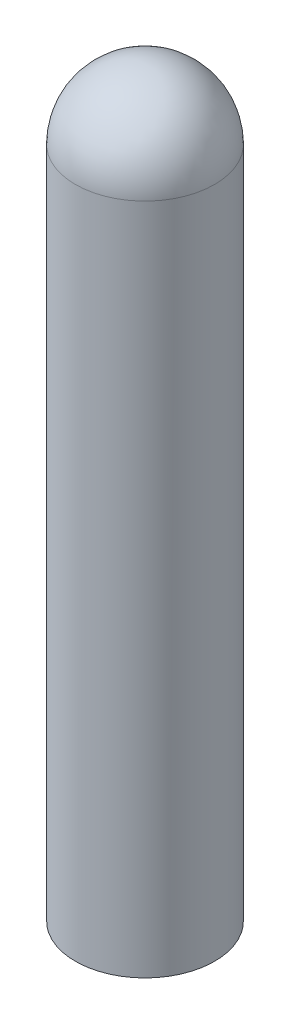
ISO-10303-21;
HEADER;
FILE_DESCRIPTION(('STEP AP214'),'2;1');
FILE_NAME('part.step','',(''),(''),'','','');
FILE_SCHEMA(('AUTOMOTIVE_DESIGN { 1 0 10303 214 1 1 1 1 }'));
ENDSEC;
DATA;
#1=APPLICATION_CONTEXT('core data for automotive mechanical design processes');
#2=APPLICATION_PROTOCOL_DEFINITION('international standard','automotive_design',2000,#1);
#3=PRODUCT_CONTEXT('',#1,'mechanical');
#4=PRODUCT('Part','Part','',(#3));
#5=PRODUCT_RELATED_PRODUCT_CATEGORY('part','',(#4));
#6=PRODUCT_DEFINITION_FORMATION('','',#4);
#7=PRODUCT_DEFINITION_CONTEXT('part definition',#1,'design');
#8=PRODUCT_DEFINITION('design','',#6,#7);
#9=PRODUCT_DEFINITION_SHAPE('','',#8);
#10=(LENGTH_UNIT() NAMED_UNIT(*) SI_UNIT(.MILLI.,.METRE.));
#11=(NAMED_UNIT(*) PLANE_ANGLE_UNIT() SI_UNIT($,.RADIAN.));
#12=(NAMED_UNIT(*) SI_UNIT($,.STERADIAN.) SOLID_ANGLE_UNIT());
#13=UNCERTAINTY_MEASURE_WITH_UNIT(LENGTH_MEASURE(1.E-05),#10,'distance_accuracy_value','');
#14=(GEOMETRIC_REPRESENTATION_CONTEXT(3) GLOBAL_UNCERTAINTY_ASSIGNED_CONTEXT((#13)) GLOBAL_UNIT_ASSIGNED_CONTEXT((#10,
#11,#12)) REPRESENTATION_CONTEXT('',''));
#15=CARTESIAN_POINT('',(0.,0.,0.));
#16=DIRECTION('',(0.,0.,1.));
#17=DIRECTION('',(1.,0.,0.));
#18=AXIS2_PLACEMENT_3D('',#15,#16,#17);
#19=CARTESIAN_POINT('',(0.,0.,0.));
#20=DIRECTION('',(0.,-1.,0.));
#21=DIRECTION('',(-1.,0.,0.));
#22=AXIS2_PLACEMENT_3D('',#19,#20,#21);
#23=SPHERICAL_SURFACE('',#22,10.);
#24=CARTESIAN_POINT('',(0.,-8.66025403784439,0.));
#25=DIRECTION('',(0.,-1.,0.));
#26=DIRECTION('',(0.,0.,-1.));
#27=AXIS2_PLACEMENT_3D('',#24,#25,#26);
#28=CIRCLE('',#27,5.);
#29=CARTESIAN_POINT('',(0.,-8.66025403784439,-5.));
#30=VERTEX_POINT('',#29);
#31=EDGE_CURVE('E10',#30,#30,#28,.T.);
#32=ORIENTED_EDGE('',*,*,#31,.T.);
#33=EDGE_LOOP('',(#32));
#34=FACE_BOUND('',#33,.T.);
#35=ADVANCED_FACE('F37',(#34),#23,.T.);
#36=CARTESIAN_POINT('',(0.,-10.,0.));
#37=DIRECTION('',(0.,-1.,0.));
#38=DIRECTION('',(0.,0.,-1.));
#39=AXIS2_PLACEMENT_3D('',#36,#37,#38);
#40=CYLINDRICAL_SURFACE('',#39,5.);
#41=CARTESIAN_POINT('',(0.,39.6602540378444,0.));
#42=DIRECTION('',(0.,1.,0.));
#43=DIRECTION('',(0.,0.,1.));
#44=AXIS2_PLACEMENT_3D('',#41,#42,#43);
#45=CIRCLE('',#44,5.);
#46=CARTESIAN_POINT('',(0.,39.6602540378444,5.));
#47=VERTEX_POINT('',#46);
#48=EDGE_CURVE('E43',#47,#47,#45,.T.);
#49=ORIENTED_EDGE('',*,*,#48,.F.);
#50=EDGE_LOOP('',(#49));
#51=FACE_BOUND('',#50,.T.);
#52=ORIENTED_EDGE('',*,*,#31,.F.);
#53=EDGE_LOOP('',(#52));
#54=FACE_BOUND('',#53,.T.);
#55=ADVANCED_FACE('F51',(#51,#54),#40,.T.);
#56=CARTESIAN_POINT('',(0.,39.6602540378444,0.));
#57=DIRECTION('',(0.,-1.,0.));
#58=DIRECTION('',(1.,0.,0.));
#59=AXIS2_PLACEMENT_3D('',#56,#57,#58);
#60=SPHERICAL_SURFACE('',#59,5.);
#61=ORIENTED_EDGE('',*,*,#48,.T.);
#62=EDGE_LOOP('',(#61));
#63=FACE_BOUND('',#62,.T.);
#64=ADVANCED_FACE('F49',(#63),#60,.T.);
#65=CLOSED_SHELL('',(#35,#55,#64));
#66=MANIFOLD_SOLID_BREP('B2',#65);
#67=ADVANCED_BREP_SHAPE_REPRESENTATION('',(#18,#66),#14);
#68=SHAPE_DEFINITION_REPRESENTATION(#9,#67);
ENDSEC;
END-ISO-10303-21;
